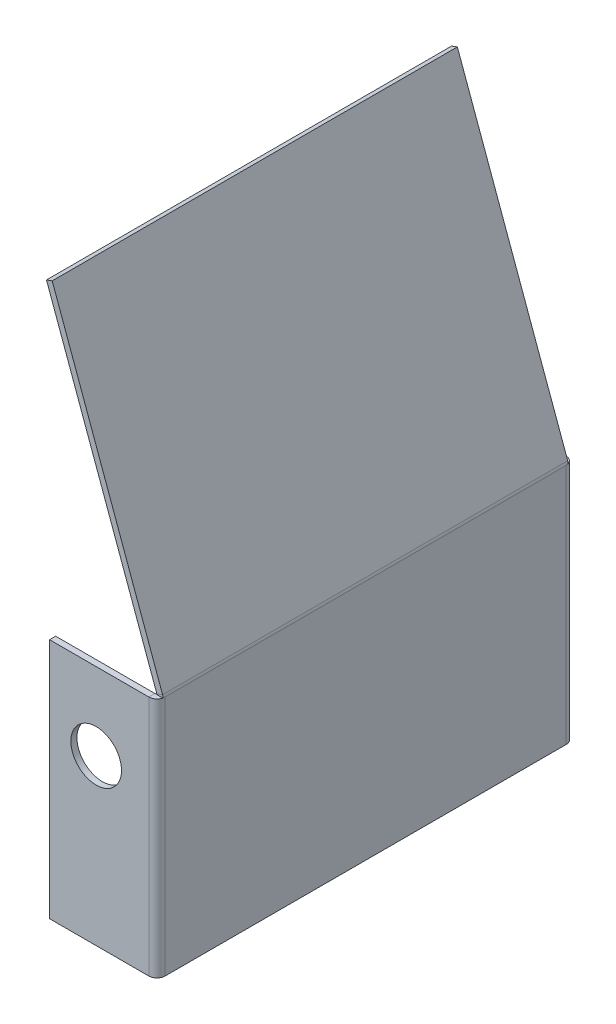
ISO-10303-21;
HEADER;
FILE_DESCRIPTION(('STEP AP214'),'2;1');
FILE_NAME('part.step','',(''),(''),'','','');
FILE_SCHEMA(('AUTOMOTIVE_DESIGN { 1 0 10303 214 1 1 1 1 }'));
ENDSEC;
DATA;
#1=APPLICATION_CONTEXT('core data for automotive mechanical design processes');
#2=APPLICATION_PROTOCOL_DEFINITION('international standard','automotive_design',2000,#1);
#3=PRODUCT_CONTEXT('',#1,'mechanical');
#4=PRODUCT('Part','Part','',(#3));
#5=PRODUCT_RELATED_PRODUCT_CATEGORY('part','',(#4));
#6=PRODUCT_DEFINITION_FORMATION('','',#4);
#7=PRODUCT_DEFINITION_CONTEXT('part definition',#1,'design');
#8=PRODUCT_DEFINITION('design','',#6,#7);
#9=PRODUCT_DEFINITION_SHAPE('','',#8);
#10=(LENGTH_UNIT() NAMED_UNIT(*) SI_UNIT(.MILLI.,.METRE.));
#11=(NAMED_UNIT(*) PLANE_ANGLE_UNIT() SI_UNIT($,.RADIAN.));
#12=(NAMED_UNIT(*) SI_UNIT($,.STERADIAN.) SOLID_ANGLE_UNIT());
#13=UNCERTAINTY_MEASURE_WITH_UNIT(LENGTH_MEASURE(1.E-05),#10,'distance_accuracy_value','');
#14=(GEOMETRIC_REPRESENTATION_CONTEXT(3) GLOBAL_UNCERTAINTY_ASSIGNED_CONTEXT((#13)) GLOBAL_UNIT_ASSIGNED_CONTEXT((#10,
#11,#12)) REPRESENTATION_CONTEXT('',''));
#15=CARTESIAN_POINT('',(0.,0.,0.));
#16=DIRECTION('',(0.,0.,1.));
#17=DIRECTION('',(1.,0.,0.));
#18=AXIS2_PLACEMENT_3D('',#15,#16,#17);
#19=CARTESIAN_POINT('',(-1.49999999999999,-0.352653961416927,0.499999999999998));
#20=DIRECTION('',(0.,-1.,0.));
#21=DIRECTION('',(0.,0.,-1.));
#22=AXIS2_PLACEMENT_3D('',#19,#20,#21);
#23=PLANE('',#22);
#24=DIRECTION('',(0.,0.,-1.));
#25=VECTOR('',#24,1.);
#26=CARTESIAN_POINT('',(0.,-0.352653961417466,100.));
#27=LINE('',#26,#25);
#28=CARTESIAN_POINT('',(0.,-0.352653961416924,0.5));
#29=VERTEX_POINT('',#28);
#30=CARTESIAN_POINT('',(0.,-0.352653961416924,0.));
#31=VERTEX_POINT('',#30);
#32=EDGE_CURVE('E289',#29,#31,#27,.T.);
#33=ORIENTED_EDGE('',*,*,#32,.F.);
#34=CARTESIAN_POINT('',(-1.99999999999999,-0.352653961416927,0.499999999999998));
#35=DIRECTION('',(0.,-1.,0.));
#36=DIRECTION('',(0.,0.,-1.));
#37=AXIS2_PLACEMENT_3D('',#34,#35,#36);
#38=CIRCLE('',#37,2.);
#39=CARTESIAN_POINT('',(-0.063508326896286,-0.352653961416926,0.));
#40=VERTEX_POINT('',#39);
#41=EDGE_CURVE('E226',#29,#40,#38,.F.);
#42=ORIENTED_EDGE('',*,*,#41,.T.);
#43=DIRECTION('',(1.,0.,0.));
#44=VECTOR('',#43,1.);
#45=CARTESIAN_POINT('',(-1.5,-0.352653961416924,0.));
#46=LINE('',#45,#44);
#47=EDGE_CURVE('E343',#40,#31,#46,.T.);
#48=ORIENTED_EDGE('',*,*,#47,.T.);
#49=EDGE_LOOP('',(#33,#42,#48));
#50=FACE_BOUND('',#49,.T.);
#51=ADVANCED_FACE('F37',(#50),#23,.T.);
#52=CARTESIAN_POINT('',(-1.5,-0.352653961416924,100.));
#53=DIRECTION('',(0.,-1.,0.));
#54=DIRECTION('',(0.,0.,-1.));
#55=AXIS2_PLACEMENT_3D('',#52,#53,#54);
#56=PLANE('',#55);
#57=DIRECTION('',(-1.,0.,0.));
#58=VECTOR('',#57,1.);
#59=CARTESIAN_POINT('',(0.,-0.352653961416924,100.));
#60=LINE('',#59,#58);
#61=CARTESIAN_POINT('',(0.,-0.352653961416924,100.));
#62=VERTEX_POINT('',#61);
#63=CARTESIAN_POINT('',(-0.0635083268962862,-0.352653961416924,100.));
#64=VERTEX_POINT('',#63);
#65=EDGE_CURVE('E46',#62,#64,#60,.T.);
#66=ORIENTED_EDGE('',*,*,#65,.T.);
#67=CARTESIAN_POINT('',(-1.99999999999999,-0.352653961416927,99.5));
#68=DIRECTION('',(0.,1.,0.));
#69=DIRECTION('',(0.,0.,1.));
#70=AXIS2_PLACEMENT_3D('',#67,#68,#69);
#71=CIRCLE('',#70,2.);
#72=CARTESIAN_POINT('',(0.,-0.352653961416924,99.5));
#73=VERTEX_POINT('',#72);
#74=EDGE_CURVE('E11',#64,#73,#71,.T.);
#75=ORIENTED_EDGE('',*,*,#74,.T.);
#76=DIRECTION('',(0.,0.,-1.));
#77=VECTOR('',#76,1.);
#78=CARTESIAN_POINT('',(0.,-0.352653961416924,100.));
#79=LINE('',#78,#77);
#80=EDGE_CURVE('E336',#62,#73,#79,.T.);
#81=ORIENTED_EDGE('',*,*,#80,.F.);
#82=EDGE_LOOP('',(#66,#75,#81));
#83=FACE_BOUND('',#82,.T.);
#84=ADVANCED_FACE('F363',(#83),#56,.T.);
#85=CARTESIAN_POINT('',(-1.5,0.,100.));
#86=DIRECTION('',(1.,0.,0.));
#87=DIRECTION('',(0.,1.,0.));
#88=AXIS2_PLACEMENT_3D('',#85,#86,#87);
#89=PLANE('',#88);
#90=DIRECTION('',(0.,-1.,0.));
#91=VECTOR('',#90,1.);
#92=CARTESIAN_POINT('',(-1.49999999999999,-60.,0.499999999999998));
#93=LINE('',#92,#91);
#94=CARTESIAN_POINT('',(-1.49999999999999,-60.,0.5));
#95=VERTEX_POINT('',#94);
#96=CARTESIAN_POINT('',(-1.5,-0.352653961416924,0.5));
#97=VERTEX_POINT('',#96);
#98=EDGE_CURVE('E231',#95,#97,#93,.F.);
#99=ORIENTED_EDGE('',*,*,#98,.F.);
#100=DIRECTION('',(0.,0.,-1.));
#101=VECTOR('',#100,1.);
#102=CARTESIAN_POINT('',(-1.49999999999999,-60.,100.));
#103=LINE('',#102,#101);
#104=CARTESIAN_POINT('',(-1.49999999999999,-60.,99.5));
#105=VERTEX_POINT('',#104);
#106=EDGE_CURVE('E341',#105,#95,#103,.T.);
#107=ORIENTED_EDGE('',*,*,#106,.F.);
#108=DIRECTION('',(0.,1.,0.));
#109=VECTOR('',#108,1.);
#110=CARTESIAN_POINT('',(-1.49999999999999,-0.352653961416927,99.5));
#111=LINE('',#110,#109);
#112=CARTESIAN_POINT('',(-1.49999999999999,-0.352653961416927,99.5));
#113=VERTEX_POINT('',#112);
#114=EDGE_CURVE('E279',#113,#105,#111,.F.);
#115=ORIENTED_EDGE('',*,*,#114,.F.);
#116=DIRECTION('',(0.,0.,-1.));
#117=VECTOR('',#116,1.);
#118=CARTESIAN_POINT('',(-1.5,-0.352653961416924,100.));
#119=LINE('',#118,#117);
#120=EDGE_CURVE('E308',#113,#97,#119,.T.);
#121=ORIENTED_EDGE('',*,*,#120,.T.);
#122=EDGE_LOOP('',(#99,#107,#115,#121));
#123=FACE_BOUND('',#122,.T.);
#124=ADVANCED_FACE('F395',(#123),#89,.F.);
#125=CARTESIAN_POINT('',(0.,0.,100.));
#126=DIRECTION('',(1.,0.,0.));
#127=DIRECTION('',(0.,1.,0.));
#128=AXIS2_PLACEMENT_3D('',#125,#126,#127);
#129=PLANE('',#128);
#130=DIRECTION('',(0.,0.,-1.));
#131=VECTOR('',#130,1.);
#132=CARTESIAN_POINT('',(0.,-60.,100.));
#133=LINE('',#132,#131);
#134=CARTESIAN_POINT('',(0.,-60.,99.5));
#135=VERTEX_POINT('',#134);
#136=CARTESIAN_POINT('',(0.,-60.,0.5));
#137=VERTEX_POINT('',#136);
#138=EDGE_CURVE('E339',#135,#137,#133,.T.);
#139=ORIENTED_EDGE('',*,*,#138,.T.);
#140=DIRECTION('',(0.,-1.,0.));
#141=VECTOR('',#140,1.);
#142=CARTESIAN_POINT('',(0.,-60.,0.499999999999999));
#143=LINE('',#142,#141);
#144=EDGE_CURVE('E181',#137,#29,#143,.F.);
#145=ORIENTED_EDGE('',*,*,#144,.T.);
#146=EDGE_CURVE('E335',#73,#29,#79,.T.);
#147=ORIENTED_EDGE('',*,*,#146,.F.);
#148=DIRECTION('',(0.,1.,0.));
#149=VECTOR('',#148,1.);
#150=CARTESIAN_POINT('',(0.,-0.352653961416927,99.5));
#151=LINE('',#150,#149);
#152=EDGE_CURVE('E269',#73,#135,#151,.F.);
#153=ORIENTED_EDGE('',*,*,#152,.T.);
#154=EDGE_LOOP('',(#139,#145,#147,#153));
#155=FACE_BOUND('',#154,.T.);
#156=ADVANCED_FACE('F366',(#155),#129,.T.);
#157=CARTESIAN_POINT('',(0.,-60.,100.));
#158=DIRECTION('',(0.,-1.,0.));
#159=DIRECTION('',(0.,0.,-1.));
#160=AXIS2_PLACEMENT_3D('',#157,#158,#159);
#161=PLANE('',#160);
#162=ORIENTED_EDGE('',*,*,#106,.T.);
#163=DIRECTION('',(1.,0.,0.));
#164=VECTOR('',#163,1.);
#165=CARTESIAN_POINT('',(-1.49999999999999,-60.,0.499999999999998));
#166=LINE('',#165,#164);
#167=EDGE_CURVE('E63',#95,#137,#166,.T.);
#168=ORIENTED_EDGE('',*,*,#167,.T.);
#169=ORIENTED_EDGE('',*,*,#138,.F.);
#170=DIRECTION('',(1.,0.,0.));
#171=VECTOR('',#170,1.);
#172=CARTESIAN_POINT('',(-1.49999999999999,-60.,99.5));
#173=LINE('',#172,#171);
#174=EDGE_CURVE('E273',#105,#135,#173,.T.);
#175=ORIENTED_EDGE('',*,*,#174,.F.);
#176=EDGE_LOOP('',(#162,#168,#169,#175));
#177=FACE_BOUND('',#176,.T.);
#178=ADVANCED_FACE('F457',(#177),#161,.T.);
#179=CARTESIAN_POINT('',(0.,-0.352653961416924,100.));
#180=DIRECTION('',(0.,0.,1.));
#181=DIRECTION('',(1.,0.,0.));
#182=AXIS2_PLACEMENT_3D('',#179,#180,#181);
#183=PLANE('',#182);
#184=ORIENTED_EDGE('',*,*,#65,.F.);
#185=CARTESIAN_POINT('',(-2.,-0.352653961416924,100.));
#186=DIRECTION('',(0.,0.,1.));
#187=DIRECTION('',(1.,0.,0.));
#188=AXIS2_PLACEMENT_3D('',#185,#186,#187);
#189=CIRCLE('',#188,2.);
#190=CARTESIAN_POINT('',(-0.120614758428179,0.331386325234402,100.));
#191=VERTEX_POINT('',#190);
#192=EDGE_CURVE('E293',#191,#62,#189,.F.);
#193=ORIENTED_EDGE('',*,*,#192,.F.);
#194=DIRECTION('',(0.93969262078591,0.342020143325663,0.));
#195=VECTOR('',#194,1.);
#196=CARTESIAN_POINT('',(-1.53015368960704,-0.181643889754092,100.));
#197=LINE('',#196,#195);
#198=CARTESIAN_POINT('',(-1.53015368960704,-0.181643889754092,100.));
#199=VERTEX_POINT('',#198);
#200=EDGE_CURVE('E349',#199,#191,#197,.T.);
#201=ORIENTED_EDGE('',*,*,#200,.F.);
#202=CARTESIAN_POINT('',(-2.,-0.352653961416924,100.));
#203=DIRECTION('',(0.,0.,1.));
#204=DIRECTION('',(1.,0.,0.));
#205=AXIS2_PLACEMENT_3D('',#202,#203,#204);
#206=CIRCLE('',#205,0.5);
#207=CARTESIAN_POINT('',(-1.5,-0.352653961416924,100.));
#208=VERTEX_POINT('',#207);
#209=EDGE_CURVE('E306',#199,#208,#206,.F.);
#210=ORIENTED_EDGE('',*,*,#209,.T.);
#211=EDGE_CURVE('E55',#64,#208,#60,.T.);
#212=ORIENTED_EDGE('',*,*,#211,.F.);
#213=EDGE_LOOP('',(#184,#193,#201,#210,#212));
#214=FACE_BOUND('',#213,.T.);
#215=ADVANCED_FACE('F39',(#214),#183,.T.);
#216=CARTESIAN_POINT('',(-0.120614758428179,0.331386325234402,0.));
#217=DIRECTION('',(0.,0.,-1.));
#218=DIRECTION('',(-1.,0.,0.));
#219=AXIS2_PLACEMENT_3D('',#216,#217,#218);
#220=PLANE('',#219);
#221=DIRECTION('',(-0.93969262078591,-0.342020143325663,0.));
#222=VECTOR('',#221,1.);
#223=CARTESIAN_POINT('',(-0.120614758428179,0.331386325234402,0.));
#224=LINE('',#223,#222);
#225=CARTESIAN_POINT('',(-0.120614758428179,0.331386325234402,0.));
#226=VERTEX_POINT('',#225);
#227=CARTESIAN_POINT('',(-1.53015368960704,-0.181643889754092,0.));
#228=VERTEX_POINT('',#227);
#229=EDGE_CURVE('E347',#226,#228,#224,.T.);
#230=ORIENTED_EDGE('',*,*,#229,.F.);
#231=CARTESIAN_POINT('',(-2.,-0.352653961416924,0.));
#232=DIRECTION('',(0.,0.,1.));
#233=DIRECTION('',(1.,0.,0.));
#234=AXIS2_PLACEMENT_3D('',#231,#232,#233);
#235=CIRCLE('',#234,2.);
#236=EDGE_CURVE('E292',#226,#31,#235,.F.);
#237=ORIENTED_EDGE('',*,*,#236,.T.);
#238=ORIENTED_EDGE('',*,*,#47,.F.);
#239=CARTESIAN_POINT('',(-1.5,-0.352653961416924,0.));
#240=VERTEX_POINT('',#239);
#241=EDGE_CURVE('E344',#240,#40,#46,.T.);
#242=ORIENTED_EDGE('',*,*,#241,.F.);
#243=CARTESIAN_POINT('',(-2.,-0.352653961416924,0.));
#244=DIRECTION('',(0.,0.,1.));
#245=DIRECTION('',(1.,0.,0.));
#246=AXIS2_PLACEMENT_3D('',#243,#244,#245);
#247=CIRCLE('',#246,0.5);
#248=EDGE_CURVE('E297',#228,#240,#247,.F.);
#249=ORIENTED_EDGE('',*,*,#248,.F.);
#250=EDGE_LOOP('',(#230,#237,#238,#242,#249));
#251=FACE_BOUND('',#250,.T.);
#252=ADVANCED_FACE('F463',(#251),#220,.T.);
#253=CARTESIAN_POINT('',(-1.5,-0.352653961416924,0.));
#254=DIRECTION('',(0.,0.,-1.));
#255=DIRECTION('',(-1.,0.,0.));
#256=AXIS2_PLACEMENT_3D('',#253,#254,#255);
#257=PLANE('',#256);
#258=DIRECTION('',(0.342020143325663,-0.93969262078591,0.));
#259=VECTOR('',#258,1.);
#260=CARTESIAN_POINT('',(0.,0.,0.));
#261=LINE('',#260,#259);
#262=CARTESIAN_POINT('',(-27.3616114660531,75.1754096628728,0.));
#263=VERTEX_POINT('',#262);
#264=EDGE_CURVE('E311',#263,#226,#261,.T.);
#265=ORIENTED_EDGE('',*,*,#264,.T.);
#266=ORIENTED_EDGE('',*,*,#229,.T.);
#267=DIRECTION('',(0.342020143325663,-0.939692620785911,0.));
#268=VECTOR('',#267,1.);
#269=CARTESIAN_POINT('',(-1.40953893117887,-0.513030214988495,0.));
#270=LINE('',#269,#268);
#271=CARTESIAN_POINT('',(-28.7711503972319,74.6623794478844,0.));
#272=VERTEX_POINT('',#271);
#273=EDGE_CURVE('E317',#272,#228,#270,.T.);
#274=ORIENTED_EDGE('',*,*,#273,.F.);
#275=DIRECTION('',(0.93969262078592,0.342020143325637,0.));
#276=VECTOR('',#275,1.);
#277=CARTESIAN_POINT('',(-28.7711503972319,74.6623794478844,0.));
#278=LINE('',#277,#276);
#279=EDGE_CURVE('E314',#272,#263,#278,.T.);
#280=ORIENTED_EDGE('',*,*,#279,.T.);
#281=EDGE_LOOP('',(#265,#266,#274,#280));
#282=FACE_BOUND('',#281,.T.);
#283=ADVANCED_FACE('F454',(#282),#257,.T.);
#284=CARTESIAN_POINT('',(-2.,-0.352653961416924,100.));
#285=DIRECTION('',(0.,0.,-1.));
#286=DIRECTION('',(-1.,0.,0.));
#287=AXIS2_PLACEMENT_3D('',#284,#285,#286);
#288=CYLINDRICAL_SURFACE('',#287,2.);
#289=ORIENTED_EDGE('',*,*,#236,.F.);
#290=DIRECTION('',(0.,0.,-1.));
#291=VECTOR('',#290,1.);
#292=CARTESIAN_POINT('',(-0.120614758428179,0.331386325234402,100.));
#293=LINE('',#292,#291);
#294=EDGE_CURVE('E332',#191,#226,#293,.T.);
#295=ORIENTED_EDGE('',*,*,#294,.F.);
#296=ORIENTED_EDGE('',*,*,#192,.T.);
#297=ORIENTED_EDGE('',*,*,#80,.T.);
#298=ORIENTED_EDGE('',*,*,#146,.T.);
#299=ORIENTED_EDGE('',*,*,#32,.T.);
#300=EDGE_LOOP('',(#289,#295,#296,#297,#298,#299));
#301=FACE_BOUND('',#300,.T.);
#302=ADVANCED_FACE('F370',(#301),#288,.T.);
#303=CARTESIAN_POINT('',(0.,0.,100.));
#304=DIRECTION('',(0.93969262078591,0.342020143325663,0.));
#305=DIRECTION('',(-0.342020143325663,0.93969262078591,0.));
#306=AXIS2_PLACEMENT_3D('',#303,#304,#305);
#307=PLANE('',#306);
#308=ORIENTED_EDGE('',*,*,#264,.F.);
#309=DIRECTION('',(0.,0.,-1.));
#310=VECTOR('',#309,1.);
#311=CARTESIAN_POINT('',(-27.3616114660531,75.1754096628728,100.));
#312=LINE('',#311,#310);
#313=CARTESIAN_POINT('',(-27.3616114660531,75.1754096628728,100.));
#314=VERTEX_POINT('',#313);
#315=EDGE_CURVE('E330',#314,#263,#312,.T.);
#316=ORIENTED_EDGE('',*,*,#315,.F.);
#317=DIRECTION('',(0.342020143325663,-0.93969262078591,0.));
#318=VECTOR('',#317,1.);
#319=CARTESIAN_POINT('',(0.,0.,100.));
#320=LINE('',#319,#318);
#321=EDGE_CURVE('E296',#314,#191,#320,.T.);
#322=ORIENTED_EDGE('',*,*,#321,.T.);
#323=ORIENTED_EDGE('',*,*,#294,.T.);
#324=EDGE_LOOP('',(#308,#316,#322,#323));
#325=FACE_BOUND('',#324,.T.);
#326=ADVANCED_FACE('F376',(#325),#307,.T.);
#327=CARTESIAN_POINT('',(-28.7711503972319,74.6623794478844,100.));
#328=DIRECTION('',(-0.342020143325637,0.93969262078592,0.));
#329=DIRECTION('',(-0.93969262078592,-0.342020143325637,0.));
#330=AXIS2_PLACEMENT_3D('',#327,#328,#329);
#331=PLANE('',#330);
#332=ORIENTED_EDGE('',*,*,#279,.F.);
#333=DIRECTION('',(0.,0.,-1.));
#334=VECTOR('',#333,1.);
#335=CARTESIAN_POINT('',(-28.7711503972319,74.6623794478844,100.));
#336=LINE('',#335,#334);
#337=CARTESIAN_POINT('',(-28.7711503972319,74.6623794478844,100.));
#338=VERTEX_POINT('',#337);
#339=EDGE_CURVE('E328',#338,#272,#336,.T.);
#340=ORIENTED_EDGE('',*,*,#339,.F.);
#341=DIRECTION('',(0.93969262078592,0.342020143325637,0.));
#342=VECTOR('',#341,1.);
#343=CARTESIAN_POINT('',(-28.7711503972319,74.6623794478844,100.));
#344=LINE('',#343,#342);
#345=EDGE_CURVE('E300',#338,#314,#344,.T.);
#346=ORIENTED_EDGE('',*,*,#345,.T.);
#347=ORIENTED_EDGE('',*,*,#315,.T.);
#348=EDGE_LOOP('',(#332,#340,#346,#347));
#349=FACE_BOUND('',#348,.T.);
#350=ADVANCED_FACE('F382',(#349),#331,.T.);
#351=CARTESIAN_POINT('',(-1.40953893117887,-0.513030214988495,100.));
#352=DIRECTION('',(0.93969262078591,0.342020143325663,0.));
#353=DIRECTION('',(-0.342020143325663,0.93969262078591,0.));
#354=AXIS2_PLACEMENT_3D('',#351,#352,#353);
#355=PLANE('',#354);
#356=ORIENTED_EDGE('',*,*,#273,.T.);
#357=DIRECTION('',(0.,0.,-1.));
#358=VECTOR('',#357,1.);
#359=CARTESIAN_POINT('',(-1.53015368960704,-0.181643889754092,100.));
#360=LINE('',#359,#358);
#361=EDGE_CURVE('E325',#199,#228,#360,.T.);
#362=ORIENTED_EDGE('',*,*,#361,.F.);
#363=DIRECTION('',(0.342020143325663,-0.939692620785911,0.));
#364=VECTOR('',#363,1.);
#365=CARTESIAN_POINT('',(-1.40953893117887,-0.513030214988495,100.));
#366=LINE('',#365,#364);
#367=EDGE_CURVE('E303',#338,#199,#366,.T.);
#368=ORIENTED_EDGE('',*,*,#367,.F.);
#369=ORIENTED_EDGE('',*,*,#339,.T.);
#370=EDGE_LOOP('',(#356,#362,#368,#369));
#371=FACE_BOUND('',#370,.T.);
#372=ADVANCED_FACE('F387',(#371),#355,.F.);
#373=CARTESIAN_POINT('',(-2.,-0.352653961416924,100.));
#374=DIRECTION('',(0.,0.,-1.));
#375=DIRECTION('',(-1.,0.,0.));
#376=AXIS2_PLACEMENT_3D('',#373,#374,#375);
#377=CYLINDRICAL_SURFACE('',#376,0.5);
#378=ORIENTED_EDGE('',*,*,#248,.T.);
#379=DIRECTION('',(0.,0.,-1.));
#380=VECTOR('',#379,1.);
#381=CARTESIAN_POINT('',(-1.49999999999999,-0.352653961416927,0.499999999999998));
#382=LINE('',#381,#380);
#383=EDGE_CURVE('E286',#97,#240,#382,.T.);
#384=ORIENTED_EDGE('',*,*,#383,.F.);
#385=ORIENTED_EDGE('',*,*,#120,.F.);
#386=EDGE_CURVE('E322',#208,#113,#119,.T.);
#387=ORIENTED_EDGE('',*,*,#386,.F.);
#388=ORIENTED_EDGE('',*,*,#209,.F.);
#389=ORIENTED_EDGE('',*,*,#361,.T.);
#390=EDGE_LOOP('',(#378,#384,#385,#387,#388,#389));
#391=FACE_BOUND('',#390,.T.);
#392=ADVANCED_FACE('F391',(#391),#377,.F.);
#393=CARTESIAN_POINT('',(-2.,-0.352653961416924,100.));
#394=DIRECTION('',(0.,0.,1.));
#395=DIRECTION('',(1.,0.,0.));
#396=AXIS2_PLACEMENT_3D('',#393,#394,#395);
#397=PLANE('',#396);
#398=ORIENTED_EDGE('',*,*,#367,.T.);
#399=ORIENTED_EDGE('',*,*,#200,.T.);
#400=ORIENTED_EDGE('',*,*,#321,.F.);
#401=ORIENTED_EDGE('',*,*,#345,.F.);
#402=EDGE_LOOP('',(#398,#399,#400,#401));
#403=FACE_BOUND('',#402,.T.);
#404=ADVANCED_FACE('F379',(#403),#397,.T.);
#405=CARTESIAN_POINT('',(-1.99999999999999,-60.,99.5));
#406=DIRECTION('',(0.,-1.,0.));
#407=DIRECTION('',(0.,0.,-1.));
#408=AXIS2_PLACEMENT_3D('',#405,#406,#407);
#409=PLANE('',#408);
#410=DIRECTION('',(0.,0.,1.));
#411=VECTOR('',#410,1.);
#412=CARTESIAN_POINT('',(-1.99999999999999,-60.,100.));
#413=LINE('',#412,#411);
#414=CARTESIAN_POINT('',(-1.99999999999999,-60.,100.));
#415=VERTEX_POINT('',#414);
#416=CARTESIAN_POINT('',(-1.99999999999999,-60.,101.5));
#417=VERTEX_POINT('',#416);
#418=EDGE_CURVE('E236',#415,#417,#413,.T.);
#419=ORIENTED_EDGE('',*,*,#418,.F.);
#420=CARTESIAN_POINT('',(-1.99999999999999,-60.,99.5));
#421=DIRECTION('',(0.,1.,0.));
#422=DIRECTION('',(0.,0.,1.));
#423=AXIS2_PLACEMENT_3D('',#420,#421,#422);
#424=CIRCLE('',#423,0.5);
#425=EDGE_CURVE('E276',#105,#415,#424,.F.);
#426=ORIENTED_EDGE('',*,*,#425,.F.);
#427=ORIENTED_EDGE('',*,*,#174,.T.);
#428=CARTESIAN_POINT('',(-1.99999999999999,-60.,99.5));
#429=DIRECTION('',(0.,1.,0.));
#430=DIRECTION('',(0.,0.,1.));
#431=AXIS2_PLACEMENT_3D('',#428,#429,#430);
#432=CIRCLE('',#431,2.);
#433=EDGE_CURVE('E271',#135,#417,#432,.F.);
#434=ORIENTED_EDGE('',*,*,#433,.T.);
#435=EDGE_LOOP('',(#419,#426,#427,#434));
#436=FACE_BOUND('',#435,.T.);
#437=ADVANCED_FACE('F443',(#436),#409,.T.);
#438=CARTESIAN_POINT('',(-1.99999999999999,-0.352653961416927,99.5));
#439=DIRECTION('',(0.,-1.,0.));
#440=DIRECTION('',(0.,0.,-1.));
#441=AXIS2_PLACEMENT_3D('',#438,#439,#440);
#442=PLANE('',#441);
#443=CARTESIAN_POINT('',(-1.99999999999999,-0.352653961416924,101.5));
#444=VERTEX_POINT('',#443);
#445=EDGE_CURVE('E48',#444,#64,#71,.T.);
#446=ORIENTED_EDGE('',*,*,#445,.T.);
#447=ORIENTED_EDGE('',*,*,#211,.T.);
#448=ORIENTED_EDGE('',*,*,#386,.T.);
#449=CARTESIAN_POINT('',(-1.99999999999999,-0.352653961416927,99.5));
#450=DIRECTION('',(0.,1.,0.));
#451=DIRECTION('',(0.,0.,1.));
#452=AXIS2_PLACEMENT_3D('',#449,#450,#451);
#453=CIRCLE('',#452,0.5);
#454=CARTESIAN_POINT('',(-1.99999999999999,-0.352653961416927,100.));
#455=VERTEX_POINT('',#454);
#456=EDGE_CURVE('E266',#455,#113,#453,.T.);
#457=ORIENTED_EDGE('',*,*,#456,.F.);
#458=DIRECTION('',(0.,0.,1.));
#459=VECTOR('',#458,1.);
#460=CARTESIAN_POINT('',(-2.,-0.352653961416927,100.));
#461=LINE('',#460,#459);
#462=EDGE_CURVE('E239',#455,#444,#461,.T.);
#463=ORIENTED_EDGE('',*,*,#462,.T.);
#464=EDGE_LOOP('',(#446,#447,#448,#457,#463));
#465=FACE_BOUND('',#464,.T.);
#466=ADVANCED_FACE('F354',(#465),#442,.F.);
#467=CARTESIAN_POINT('',(-1.99999999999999,-0.352653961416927,99.5));
#468=DIRECTION('',(0.,1.,0.));
#469=DIRECTION('',(0.,0.,1.));
#470=AXIS2_PLACEMENT_3D('',#467,#468,#469);
#471=CYLINDRICAL_SURFACE('',#470,2.);
#472=ORIENTED_EDGE('',*,*,#152,.F.);
#473=ORIENTED_EDGE('',*,*,#74,.F.);
#474=ORIENTED_EDGE('',*,*,#445,.F.);
#475=DIRECTION('',(0.,1.,0.));
#476=VECTOR('',#475,1.);
#477=CARTESIAN_POINT('',(-2.,0.,101.5));
#478=LINE('',#477,#476);
#479=EDGE_CURVE('E242',#417,#444,#478,.T.);
#480=ORIENTED_EDGE('',*,*,#479,.F.);
#481=ORIENTED_EDGE('',*,*,#433,.F.);
#482=EDGE_LOOP('',(#472,#473,#474,#480,#481));
#483=FACE_BOUND('',#482,.T.);
#484=ADVANCED_FACE('F360',(#483),#471,.T.);
#485=CARTESIAN_POINT('',(-1.99999999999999,-0.352653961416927,99.5));
#486=DIRECTION('',(0.,1.,0.));
#487=DIRECTION('',(0.,0.,1.));
#488=AXIS2_PLACEMENT_3D('',#485,#486,#487);
#489=CYLINDRICAL_SURFACE('',#488,0.5);
#490=ORIENTED_EDGE('',*,*,#114,.T.);
#491=ORIENTED_EDGE('',*,*,#425,.T.);
#492=DIRECTION('',(0.,1.,0.));
#493=VECTOR('',#492,1.);
#494=CARTESIAN_POINT('',(-1.99999999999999,-60.,100.));
#495=LINE('',#494,#493);
#496=EDGE_CURVE('E237',#415,#455,#495,.T.);
#497=ORIENTED_EDGE('',*,*,#496,.T.);
#498=ORIENTED_EDGE('',*,*,#456,.T.);
#499=EDGE_LOOP('',(#490,#491,#497,#498));
#500=FACE_BOUND('',#499,.T.);
#501=ADVANCED_FACE('F572',(#500),#489,.F.);
#502=CARTESIAN_POINT('',(-1.49999999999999,-0.352653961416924,101.5));
#503=DIRECTION('',(0.,1.,0.));
#504=DIRECTION('',(-1.,0.,0.));
#505=AXIS2_PLACEMENT_3D('',#502,#503,#504);
#506=PLANE('',#505);
#507=DIRECTION('',(1.,0.,0.));
#508=VECTOR('',#507,1.);
#509=CARTESIAN_POINT('',(-1.49999999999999,-0.352653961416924,101.5));
#510=LINE('',#509,#508);
#511=CARTESIAN_POINT('',(-26.5,-0.352653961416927,101.5));
#512=VERTEX_POINT('',#511);
#513=EDGE_CURVE('E254',#512,#444,#510,.T.);
#514=ORIENTED_EDGE('',*,*,#513,.T.);
#515=ORIENTED_EDGE('',*,*,#462,.F.);
#516=DIRECTION('',(1.,0.,0.));
#517=VECTOR('',#516,1.);
#518=CARTESIAN_POINT('',(-1.5,-0.352653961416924,100.));
#519=LINE('',#518,#517);
#520=CARTESIAN_POINT('',(-26.5,-0.352653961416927,100.));
#521=VERTEX_POINT('',#520);
#522=EDGE_CURVE('E251',#521,#455,#519,.T.);
#523=ORIENTED_EDGE('',*,*,#522,.F.);
#524=DIRECTION('',(0.,0.,-1.));
#525=VECTOR('',#524,1.);
#526=CARTESIAN_POINT('',(-26.5,-0.352653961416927,101.5));
#527=LINE('',#526,#525);
#528=EDGE_CURVE('E264',#512,#521,#527,.T.);
#529=ORIENTED_EDGE('',*,*,#528,.F.);
#530=EDGE_LOOP('',(#514,#515,#523,#529));
#531=FACE_BOUND('',#530,.T.);
#532=ADVANCED_FACE('F582',(#531),#506,.T.);
#533=CARTESIAN_POINT('',(-26.5,-60.,101.5));
#534=DIRECTION('',(0.,-1.,0.));
#535=DIRECTION('',(0.,0.,-1.));
#536=AXIS2_PLACEMENT_3D('',#533,#534,#535);
#537=PLANE('',#536);
#538=DIRECTION('',(-1.,0.,0.));
#539=VECTOR('',#538,1.);
#540=CARTESIAN_POINT('',(-26.5,-60.,100.));
#541=LINE('',#540,#539);
#542=CARTESIAN_POINT('',(-26.5,-60.,100.));
#543=VERTEX_POINT('',#542);
#544=EDGE_CURVE('E247',#415,#543,#541,.T.);
#545=ORIENTED_EDGE('',*,*,#544,.F.);
#546=ORIENTED_EDGE('',*,*,#418,.T.);
#547=DIRECTION('',(-1.,0.,0.));
#548=VECTOR('',#547,1.);
#549=CARTESIAN_POINT('',(-26.5,-60.,101.5));
#550=LINE('',#549,#548);
#551=CARTESIAN_POINT('',(-26.5,-60.,101.5));
#552=VERTEX_POINT('',#551);
#553=EDGE_CURVE('E248',#417,#552,#550,.T.);
#554=ORIENTED_EDGE('',*,*,#553,.T.);
#555=DIRECTION('',(0.,0.,-1.));
#556=VECTOR('',#555,1.);
#557=CARTESIAN_POINT('',(-26.5,-60.,101.5));
#558=LINE('',#557,#556);
#559=EDGE_CURVE('E257',#552,#543,#558,.T.);
#560=ORIENTED_EDGE('',*,*,#559,.T.);
#561=EDGE_LOOP('',(#545,#546,#554,#560));
#562=FACE_BOUND('',#561,.T.);
#563=ADVANCED_FACE('F593',(#562),#537,.T.);
#564=CARTESIAN_POINT('',(3.38304129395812E-13,0.,101.5));
#565=DIRECTION('',(0.,0.,1.));
#566=DIRECTION('',(1.,0.,0.));
#567=AXIS2_PLACEMENT_3D('',#564,#565,#566);
#568=PLANE('',#567);
#569=CARTESIAN_POINT('',(-15.,-19.4280137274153,101.5));
#570=DIRECTION('',(0.,0.,1.));
#571=DIRECTION('',(1.,0.,0.));
#572=AXIS2_PLACEMENT_3D('',#569,#570,#571);
#573=CIRCLE('',#572,6.25);
#574=CARTESIAN_POINT('',(-8.75,-19.4280137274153,101.5));
#575=VERTEX_POINT('',#574);
#576=EDGE_CURVE('E785',#575,#575,#573,.T.);
#577=ORIENTED_EDGE('',*,*,#576,.F.);
#578=EDGE_LOOP('',(#577));
#579=FACE_BOUND('',#578,.T.);
#580=ORIENTED_EDGE('',*,*,#553,.F.);
#581=ORIENTED_EDGE('',*,*,#479,.T.);
#582=ORIENTED_EDGE('',*,*,#513,.F.);
#583=DIRECTION('',(0.,1.,0.));
#584=VECTOR('',#583,1.);
#585=CARTESIAN_POINT('',(-26.5,-0.352653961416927,101.5));
#586=LINE('',#585,#584);
#587=EDGE_CURVE('E250',#552,#512,#586,.T.);
#588=ORIENTED_EDGE('',*,*,#587,.F.);
#589=EDGE_LOOP('',(#580,#581,#582,#588));
#590=FACE_BOUND('',#589,.T.);
#591=ADVANCED_FACE('F604',(#579,#590),#568,.T.);
#592=CARTESIAN_POINT('',(3.33066907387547E-13,0.,100.));
#593=DIRECTION('',(0.,0.,1.));
#594=DIRECTION('',(1.,0.,0.));
#595=AXIS2_PLACEMENT_3D('',#592,#593,#594);
#596=PLANE('',#595);
#597=CARTESIAN_POINT('',(-15.,-19.4280137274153,100.));
#598=DIRECTION('',(0.,0.,1.));
#599=DIRECTION('',(1.,0.,0.));
#600=AXIS2_PLACEMENT_3D('',#597,#598,#599);
#601=CIRCLE('',#600,6.25);
#602=CARTESIAN_POINT('',(-8.75,-19.4280137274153,100.));
#603=VERTEX_POINT('',#602);
#604=EDGE_CURVE('E406',#603,#603,#601,.T.);
#605=ORIENTED_EDGE('',*,*,#604,.T.);
#606=EDGE_LOOP('',(#605));
#607=FACE_BOUND('',#606,.T.);
#608=ORIENTED_EDGE('',*,*,#496,.F.);
#609=ORIENTED_EDGE('',*,*,#544,.T.);
#610=DIRECTION('',(0.,1.,0.));
#611=VECTOR('',#610,1.);
#612=CARTESIAN_POINT('',(-26.5,-0.352653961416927,100.));
#613=LINE('',#612,#611);
#614=EDGE_CURVE('E259',#543,#521,#613,.T.);
#615=ORIENTED_EDGE('',*,*,#614,.T.);
#616=ORIENTED_EDGE('',*,*,#522,.T.);
#617=EDGE_LOOP('',(#608,#609,#615,#616));
#618=FACE_BOUND('',#617,.T.);
#619=ADVANCED_FACE('F618',(#607,#618),#596,.F.);
#620=CARTESIAN_POINT('',(-26.5,-0.352653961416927,101.5));
#621=DIRECTION('',(-1.,0.,0.));
#622=DIRECTION('',(0.,0.,1.));
#623=AXIS2_PLACEMENT_3D('',#620,#621,#622);
#624=PLANE('',#623);
#625=ORIENTED_EDGE('',*,*,#614,.F.);
#626=ORIENTED_EDGE('',*,*,#559,.F.);
#627=ORIENTED_EDGE('',*,*,#587,.T.);
#628=ORIENTED_EDGE('',*,*,#528,.T.);
#629=EDGE_LOOP('',(#625,#626,#627,#628));
#630=FACE_BOUND('',#629,.T.);
#631=ADVANCED_FACE('F613',(#630),#624,.T.);
#632=CARTESIAN_POINT('',(-1.99999999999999,-0.352653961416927,0.499999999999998));
#633=DIRECTION('',(0.,1.,0.));
#634=DIRECTION('',(0.,0.,1.));
#635=AXIS2_PLACEMENT_3D('',#632,#633,#634);
#636=PLANE('',#635);
#637=CARTESIAN_POINT('',(-1.99999999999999,-0.352653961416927,0.499999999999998));
#638=DIRECTION('',(0.,-1.,0.));
#639=DIRECTION('',(0.,0.,-1.));
#640=AXIS2_PLACEMENT_3D('',#637,#638,#639);
#641=CIRCLE('',#640,0.5);
#642=CARTESIAN_POINT('',(-1.99999999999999,-0.352653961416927,0.));
#643=VERTEX_POINT('',#642);
#644=EDGE_CURVE('E183',#97,#643,#641,.F.);
#645=ORIENTED_EDGE('',*,*,#644,.F.);
#646=ORIENTED_EDGE('',*,*,#383,.T.);
#647=ORIENTED_EDGE('',*,*,#241,.T.);
#648=CARTESIAN_POINT('',(-1.99999999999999,-0.352653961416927,-1.5));
#649=VERTEX_POINT('',#648);
#650=EDGE_CURVE('E225',#40,#649,#38,.F.);
#651=ORIENTED_EDGE('',*,*,#650,.T.);
#652=DIRECTION('',(0.,0.,-1.));
#653=VECTOR('',#652,1.);
#654=CARTESIAN_POINT('',(-2.,-0.352653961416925,0.));
#655=LINE('',#654,#653);
#656=EDGE_CURVE('E403',#643,#649,#655,.T.);
#657=ORIENTED_EDGE('',*,*,#656,.F.);
#658=EDGE_LOOP('',(#645,#646,#647,#651,#657));
#659=FACE_BOUND('',#658,.T.);
#660=ADVANCED_FACE('F402',(#659),#636,.T.);
#661=CARTESIAN_POINT('',(-1.99999999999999,-60.,0.499999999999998));
#662=DIRECTION('',(0.,1.,0.));
#663=DIRECTION('',(0.,0.,1.));
#664=AXIS2_PLACEMENT_3D('',#661,#662,#663);
#665=PLANE('',#664);
#666=CARTESIAN_POINT('',(-1.99999999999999,-60.,0.499999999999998));
#667=DIRECTION('',(0.,-1.,0.));
#668=DIRECTION('',(0.,0.,-1.));
#669=AXIS2_PLACEMENT_3D('',#666,#667,#668);
#670=CIRCLE('',#669,0.5);
#671=CARTESIAN_POINT('',(-1.99999999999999,-60.,0.));
#672=VERTEX_POINT('',#671);
#673=EDGE_CURVE('E190',#672,#95,#670,.T.);
#674=ORIENTED_EDGE('',*,*,#673,.F.);
#675=DIRECTION('',(0.,0.,-1.));
#676=VECTOR('',#675,1.);
#677=CARTESIAN_POINT('',(-1.99999999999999,-60.,0.));
#678=LINE('',#677,#676);
#679=CARTESIAN_POINT('',(-1.99999999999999,-60.,-1.5));
#680=VERTEX_POINT('',#679);
#681=EDGE_CURVE('E187',#672,#680,#678,.T.);
#682=ORIENTED_EDGE('',*,*,#681,.T.);
#683=CARTESIAN_POINT('',(-1.99999999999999,-60.,0.499999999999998));
#684=DIRECTION('',(0.,-1.,0.));
#685=DIRECTION('',(0.,0.,-1.));
#686=AXIS2_PLACEMENT_3D('',#683,#684,#685);
#687=CIRCLE('',#686,2.);
#688=EDGE_CURVE('E173',#680,#137,#687,.T.);
#689=ORIENTED_EDGE('',*,*,#688,.T.);
#690=ORIENTED_EDGE('',*,*,#167,.F.);
#691=EDGE_LOOP('',(#674,#682,#689,#690));
#692=FACE_BOUND('',#691,.T.);
#693=ADVANCED_FACE('F188',(#692),#665,.F.);
#694=CARTESIAN_POINT('',(-1.99999999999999,-60.,0.499999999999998));
#695=DIRECTION('',(0.,-1.,0.));
#696=DIRECTION('',(0.,0.,-1.));
#697=AXIS2_PLACEMENT_3D('',#694,#695,#696);
#698=CYLINDRICAL_SURFACE('',#697,2.);
#699=ORIENTED_EDGE('',*,*,#144,.F.);
#700=ORIENTED_EDGE('',*,*,#688,.F.);
#701=DIRECTION('',(0.,1.,0.));
#702=VECTOR('',#701,1.);
#703=CARTESIAN_POINT('',(-2.,0.,-1.5));
#704=LINE('',#703,#702);
#705=EDGE_CURVE('E178',#680,#649,#704,.T.);
#706=ORIENTED_EDGE('',*,*,#705,.T.);
#707=ORIENTED_EDGE('',*,*,#650,.F.);
#708=ORIENTED_EDGE('',*,*,#41,.F.);
#709=EDGE_LOOP('',(#699,#700,#706,#707,#708));
#710=FACE_BOUND('',#709,.T.);
#711=ADVANCED_FACE('F175',(#710),#698,.T.);
#712=CARTESIAN_POINT('',(-1.99999999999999,-60.,0.499999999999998));
#713=DIRECTION('',(0.,-1.,0.));
#714=DIRECTION('',(0.,0.,-1.));
#715=AXIS2_PLACEMENT_3D('',#712,#713,#714);
#716=CYLINDRICAL_SURFACE('',#715,0.5);
#717=ORIENTED_EDGE('',*,*,#98,.T.);
#718=ORIENTED_EDGE('',*,*,#644,.T.);
#719=DIRECTION('',(0.,-1.,0.));
#720=VECTOR('',#719,1.);
#721=CARTESIAN_POINT('',(-2.,-0.352653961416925,0.));
#722=LINE('',#721,#720);
#723=EDGE_CURVE('E195',#643,#672,#722,.T.);
#724=ORIENTED_EDGE('',*,*,#723,.T.);
#725=ORIENTED_EDGE('',*,*,#673,.T.);
#726=EDGE_LOOP('',(#717,#718,#724,#725));
#727=FACE_BOUND('',#726,.T.);
#728=ADVANCED_FACE('F399',(#727),#716,.F.);
#729=CARTESIAN_POINT('',(-1.49999999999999,-0.352653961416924,-1.5));
#730=DIRECTION('',(0.,1.,0.));
#731=DIRECTION('',(-1.,0.,0.));
#732=AXIS2_PLACEMENT_3D('',#729,#730,#731);
#733=PLANE('',#732);
#734=DIRECTION('',(-1.,0.,0.));
#735=VECTOR('',#734,1.);
#736=CARTESIAN_POINT('',(-1.5,-0.352653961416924,0.));
#737=LINE('',#736,#735);
#738=CARTESIAN_POINT('',(-26.5,-0.352653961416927,0.));
#739=VERTEX_POINT('',#738);
#740=EDGE_CURVE('E205',#643,#739,#737,.T.);
#741=ORIENTED_EDGE('',*,*,#740,.F.);
#742=ORIENTED_EDGE('',*,*,#656,.T.);
#743=DIRECTION('',(-1.,0.,0.));
#744=VECTOR('',#743,1.);
#745=CARTESIAN_POINT('',(-1.49999999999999,-0.352653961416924,-1.5));
#746=LINE('',#745,#744);
#747=CARTESIAN_POINT('',(-26.5,-0.352653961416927,-1.50000000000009));
#748=VERTEX_POINT('',#747);
#749=EDGE_CURVE('E204',#649,#748,#746,.T.);
#750=ORIENTED_EDGE('',*,*,#749,.T.);
#751=DIRECTION('',(0.,0.,1.));
#752=VECTOR('',#751,1.);
#753=CARTESIAN_POINT('',(-26.5,-0.352653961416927,-1.50000000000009));
#754=LINE('',#753,#752);
#755=EDGE_CURVE('E209',#748,#739,#754,.T.);
#756=ORIENTED_EDGE('',*,*,#755,.T.);
#757=EDGE_LOOP('',(#741,#742,#750,#756));
#758=FACE_BOUND('',#757,.T.);
#759=ADVANCED_FACE('F412',(#758),#733,.T.);
#760=CARTESIAN_POINT('',(-26.5,-60.,-1.50000000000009));
#761=DIRECTION('',(0.,-1.,0.));
#762=DIRECTION('',(0.,0.,-1.));
#763=AXIS2_PLACEMENT_3D('',#760,#761,#762);
#764=PLANE('',#763);
#765=DIRECTION('',(1.,0.,0.));
#766=VECTOR('',#765,1.);
#767=CARTESIAN_POINT('',(-26.5,-60.,-1.50000000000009));
#768=LINE('',#767,#766);
#769=CARTESIAN_POINT('',(-26.5,-60.,-1.50000000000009));
#770=VERTEX_POINT('',#769);
#771=EDGE_CURVE('E202',#770,#680,#768,.T.);
#772=ORIENTED_EDGE('',*,*,#771,.T.);
#773=ORIENTED_EDGE('',*,*,#681,.F.);
#774=DIRECTION('',(1.,0.,0.));
#775=VECTOR('',#774,1.);
#776=CARTESIAN_POINT('',(-26.5,-60.,0.));
#777=LINE('',#776,#775);
#778=CARTESIAN_POINT('',(-26.5,-60.,0.));
#779=VERTEX_POINT('',#778);
#780=EDGE_CURVE('E221',#779,#672,#777,.T.);
#781=ORIENTED_EDGE('',*,*,#780,.F.);
#782=DIRECTION('',(0.,0.,1.));
#783=VECTOR('',#782,1.);
#784=CARTESIAN_POINT('',(-26.5,-60.,-1.50000000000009));
#785=LINE('',#784,#783);
#786=EDGE_CURVE('E208',#770,#779,#785,.T.);
#787=ORIENTED_EDGE('',*,*,#786,.F.);
#788=EDGE_LOOP('',(#772,#773,#781,#787));
#789=FACE_BOUND('',#788,.T.);
#790=ADVANCED_FACE('F207',(#789),#764,.T.);
#791=CARTESIAN_POINT('',(0.,0.,-1.49999999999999));
#792=DIRECTION('',(0.,0.,1.));
#793=DIRECTION('',(1.,0.,0.));
#794=AXIS2_PLACEMENT_3D('',#791,#792,#793);
#795=PLANE('',#794);
#796=CARTESIAN_POINT('',(-15.,-19.4280137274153,-1.50000000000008));
#797=DIRECTION('',(0.,0.,1.));
#798=DIRECTION('',(1.,0.,0.));
#799=AXIS2_PLACEMENT_3D('',#796,#797,#798);
#800=CIRCLE('',#799,6.25);
#801=CARTESIAN_POINT('',(-8.75,-19.4280137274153,-1.50000000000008));
#802=VERTEX_POINT('',#801);
#803=EDGE_CURVE('E798',#802,#802,#800,.T.);
#804=ORIENTED_EDGE('',*,*,#803,.T.);
#805=EDGE_LOOP('',(#804));
#806=FACE_BOUND('',#805,.T.);
#807=ORIENTED_EDGE('',*,*,#705,.F.);
#808=ORIENTED_EDGE('',*,*,#771,.F.);
#809=DIRECTION('',(0.,-1.,0.));
#810=VECTOR('',#809,1.);
#811=CARTESIAN_POINT('',(-26.5,-0.352653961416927,-1.50000000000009));
#812=LINE('',#811,#810);
#813=EDGE_CURVE('E210',#748,#770,#812,.T.);
#814=ORIENTED_EDGE('',*,*,#813,.F.);
#815=ORIENTED_EDGE('',*,*,#749,.F.);
#816=EDGE_LOOP('',(#807,#808,#814,#815));
#817=FACE_BOUND('',#816,.T.);
#818=ADVANCED_FACE('F200',(#806,#817),#795,.F.);
#819=CARTESIAN_POINT('',(0.,0.,0.));
#820=DIRECTION('',(0.,0.,1.));
#821=DIRECTION('',(1.,0.,0.));
#822=AXIS2_PLACEMENT_3D('',#819,#820,#821);
#823=PLANE('',#822);
#824=CARTESIAN_POINT('',(-15.,-19.4280137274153,0.));
#825=DIRECTION('',(0.,0.,1.));
#826=DIRECTION('',(1.,0.,0.));
#827=AXIS2_PLACEMENT_3D('',#824,#825,#826);
#828=CIRCLE('',#827,6.25);
#829=CARTESIAN_POINT('',(-8.75,-19.4280137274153,0.));
#830=VERTEX_POINT('',#829);
#831=EDGE_CURVE('E41',#830,#830,#828,.T.);
#832=ORIENTED_EDGE('',*,*,#831,.F.);
#833=EDGE_LOOP('',(#832));
#834=FACE_BOUND('',#833,.T.);
#835=ORIENTED_EDGE('',*,*,#780,.T.);
#836=ORIENTED_EDGE('',*,*,#723,.F.);
#837=ORIENTED_EDGE('',*,*,#740,.T.);
#838=DIRECTION('',(0.,-1.,0.));
#839=VECTOR('',#838,1.);
#840=CARTESIAN_POINT('',(-26.5,-0.352653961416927,0.));
#841=LINE('',#840,#839);
#842=EDGE_CURVE('E218',#739,#779,#841,.T.);
#843=ORIENTED_EDGE('',*,*,#842,.T.);
#844=EDGE_LOOP('',(#835,#836,#837,#843));
#845=FACE_BOUND('',#844,.T.);
#846=ADVANCED_FACE('F417',(#834,#845),#823,.T.);
#847=CARTESIAN_POINT('',(-26.5,-0.352653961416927,-1.50000000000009));
#848=DIRECTION('',(-1.,0.,0.));
#849=DIRECTION('',(0.,0.,1.));
#850=AXIS2_PLACEMENT_3D('',#847,#848,#849);
#851=PLANE('',#850);
#852=ORIENTED_EDGE('',*,*,#842,.F.);
#853=ORIENTED_EDGE('',*,*,#755,.F.);
#854=ORIENTED_EDGE('',*,*,#813,.T.);
#855=ORIENTED_EDGE('',*,*,#786,.T.);
#856=EDGE_LOOP('',(#852,#853,#854,#855));
#857=FACE_BOUND('',#856,.T.);
#858=ADVANCED_FACE('F415',(#857),#851,.T.);
#859=CARTESIAN_POINT('',(-15.,-19.4280137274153,-1.50000000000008));
#860=DIRECTION('',(0.,0.,1.));
#861=DIRECTION('',(1.,0.,0.));
#862=AXIS2_PLACEMENT_3D('',#859,#860,#861);
#863=CYLINDRICAL_SURFACE('',#862,6.25);
#864=ORIENTED_EDGE('',*,*,#831,.T.);
#865=EDGE_LOOP('',(#864));
#866=FACE_BOUND('',#865,.T.);
#867=ORIENTED_EDGE('',*,*,#803,.F.);
#868=EDGE_LOOP('',(#867));
#869=FACE_BOUND('',#868,.T.);
#870=ADVANCED_FACE('F425',(#866,#869),#863,.F.);
#871=ORIENTED_EDGE('',*,*,#576,.T.);
#872=EDGE_LOOP('',(#871));
#873=FACE_BOUND('',#872,.T.);
#874=ORIENTED_EDGE('',*,*,#604,.F.);
#875=EDGE_LOOP('',(#874));
#876=FACE_BOUND('',#875,.T.);
#877=ADVANCED_FACE('F719',(#873,#876),#863,.F.);
#878=CLOSED_SHELL('',(#51,#84,#124,#156,#178,#215,#252,#283,#302,#326,#350,#372,#392,#404,#437,
#466,#484,#501,#532,#563,#591,#619,#631,#660,#693,#711,#728,#759,#790,#818,#846,#858,#870,#877));
#879=MANIFOLD_SOLID_BREP('B2',#878);
#880=ADVANCED_BREP_SHAPE_REPRESENTATION('',(#18,#879),#14);
#881=SHAPE_DEFINITION_REPRESENTATION(#9,#880);
ENDSEC;
END-ISO-10303-21;
